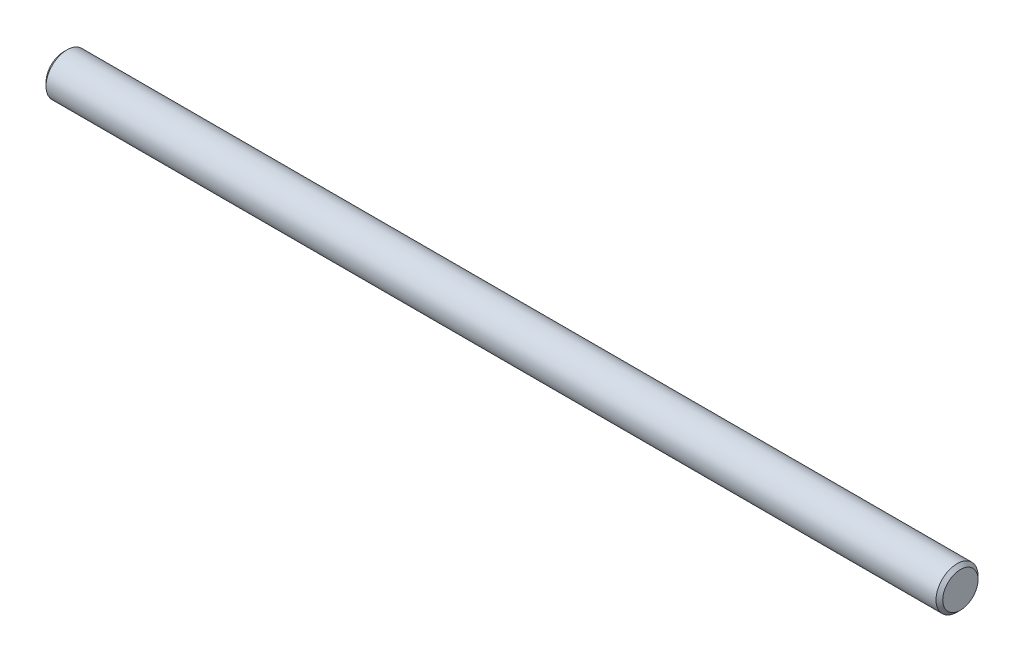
from build123d import *

# Parameters (mm, degrees)
SKETCH1_R      = 2.38125
EXTRUDE1_DEPTH = 101.6
CHAMFER1_SIZE  = 0.381


with BuildPart() as part:
    # Sketch1 → Extrude1 (new body)
    with BuildSketch(Plane(origin=(0, 0, 0), x_dir=(0, 0, -1), z_dir=(1, 0, 0))):
        Circle(SKETCH1_R)
    extrude(amount=EXTRUDE1_DEPTH)

    # Chamfer1
    chamfer1_edges = [part.edges().sort_by_distance(p)[0] for p in [
        (0, 0, 2.38125),
        (101.6, 0, 2.38125),
    ]]
    chamfer(chamfer1_edges, length=CHAMFER1_SIZE)


solid = part.part
